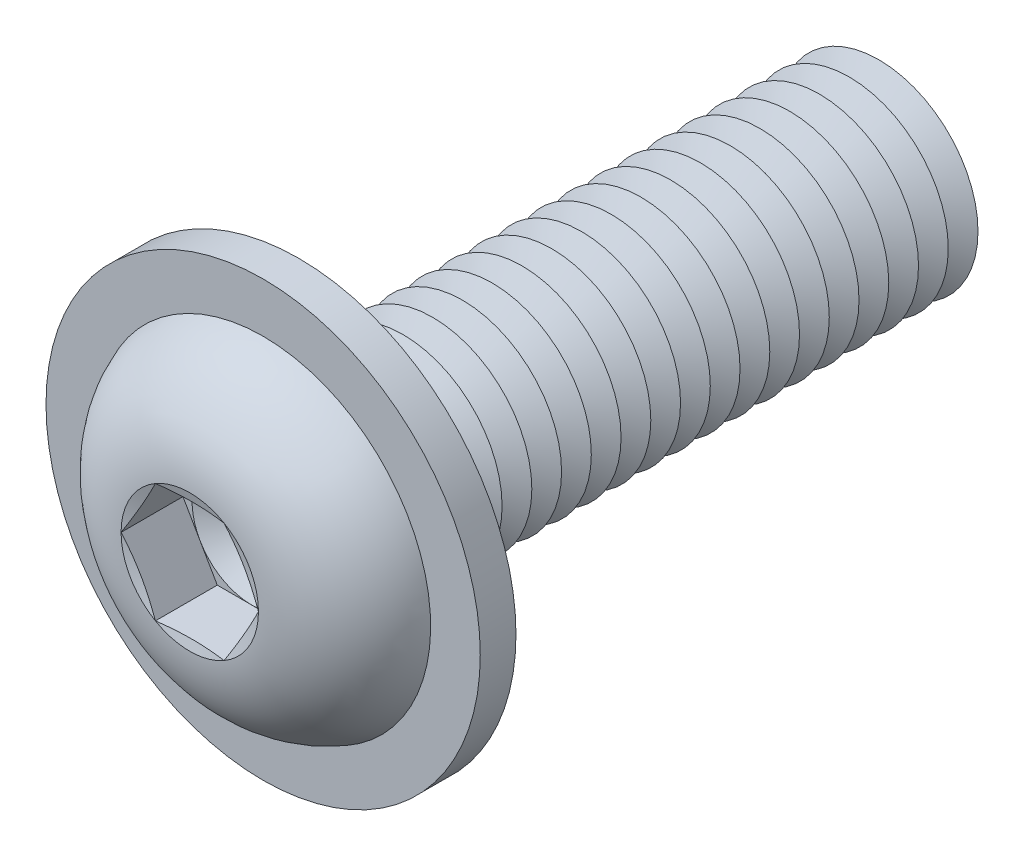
from build123d import *

# Parameters (mm, degrees)
FILLET1_R           = 0.75
LPATTERN1_COUNT     = 20
LPATTERN1_PITCH     = 1.5
CUT_EXTRUDE1_DEPTH  = 3.12
SKETCH5_R           = 10.95
SKETCH5_R_2         = 5.75
BOSS_EXTRUDE1_DEPTH = 1.8


with BuildPart() as part:
    # Sketch1 → Revolve1 (revolve)
    with BuildSketch(Plane(origin=(0, 0, 0), x_dir=(0, 0, -1), z_dir=(1, 0, 0))):
        with BuildLine():
            Line((0, 5), (0, 8.75))
            ThreePointArc((0, 8.75), (-3.814142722, 7.21429474), (-5.5, 3.4641))
            Line((-5.5, 3.4641), (-5.035898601, 1.73205))
            Line((-5.035898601, 1.73205), (-5.5, 1.73205))
            Line((-5.5, 1.73205), (-5.5, 0))
            Line((-5.5, 0), (30, 0))
            Line((30, 0), (30, 5))
            Line((30, 5), (0, 5))
        make_face()
    revolve(axis=Axis((0, 0, -30), (0, 0, 1)))

    # Fillet1
    fillet1_edges = [part.edges().sort_by_distance(p)[0] for p in [
        (0, -5, 0),
    ]]
    fillet(fillet1_edges, radius=FILLET1_R)

    # Sketch2 → Cut-Revolve1 (revolve, cut)
    with BuildSketch(Plane(origin=(0, 0, 0), x_dir=(0, 0, -1), z_dir=(1, 0, 0))):
        Polygon((29.25, 5), (30.75, 5), (30, 3.700961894), align=None)
    cut_revolve1 = revolve(axis=Axis((0, 0, -30), (0, 0, -1)), mode=Mode.SUBTRACT)

    # LPattern1: Cut-Revolve1 ×20
    with Locations(*[(0, 0, i * LPATTERN1_PITCH) for i in range(1, LPATTERN1_COUNT)]):
        add(cut_revolve1, mode=Mode.SUBTRACT)

    # Sketch3 → Cut-Extrude1 (cut)
    with BuildSketch(Plane.XY.offset(5.5)):
        Polygon((1.73205, 2.999998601), (-1.73205, 2.999998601), (-3.4641, 0), (-1.73205, -2.999998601), (1.73205, -2.999998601), (3.4641, 0), align=None)
    extrude(amount=-CUT_EXTRUDE1_DEPTH, mode=Mode.SUBTRACT)

    # Cut-Extrude2 cone 1 section (on through the dimple's axis) → Cut-Extrude2 (revolve, cut)
    with BuildSketch(Plane(origin=(0, 0, 2.38), x_dir=(0, -1, 0), z_dir=(1, 0, 0))):
        Polygon((0, 0), (2.999998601, 0), (0, 1.73205), align=None)
    revolve(axis=Axis((0, 0, 2.38), (0, 0, -1)), mode=Mode.SUBTRACT)

    # Sketch5 → Boss-Extrude1 (add)
    with BuildSketch(Plane(origin=(0, 0, 0), x_dir=(-1, 0, 0), z_dir=(0, 0, -1))):
        with Locations(Location((0, 0, 0), (0, 0, 90))):
            Circle(SKETCH5_R)
        Circle(SKETCH5_R_2, mode=Mode.SUBTRACT)
    extrude(amount=-BOSS_EXTRUDE1_DEPTH)


solid = part.part
